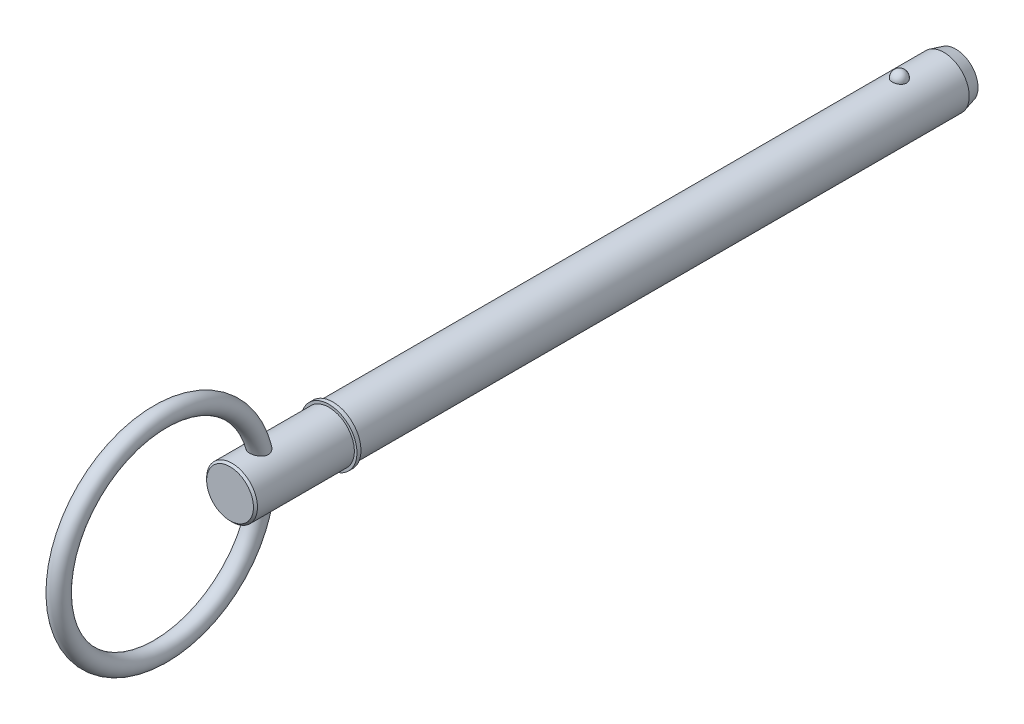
ISO-10303-21;
HEADER;
FILE_DESCRIPTION(('STEP AP214'),'2;1');
FILE_NAME('part.step','',(''),(''),'','','');
FILE_SCHEMA(('AUTOMOTIVE_DESIGN { 1 0 10303 214 1 1 1 1 }'));
ENDSEC;
DATA;
#1=APPLICATION_CONTEXT('core data for automotive mechanical design processes');
#2=APPLICATION_PROTOCOL_DEFINITION('international standard','automotive_design',2000,#1);
#3=PRODUCT_CONTEXT('',#1,'mechanical');
#4=PRODUCT('Part','Part','',(#3));
#5=PRODUCT_RELATED_PRODUCT_CATEGORY('part','',(#4));
#6=PRODUCT_DEFINITION_FORMATION('','',#4);
#7=PRODUCT_DEFINITION_CONTEXT('part definition',#1,'design');
#8=PRODUCT_DEFINITION('design','',#6,#7);
#9=PRODUCT_DEFINITION_SHAPE('','',#8);
#10=(LENGTH_UNIT() NAMED_UNIT(*) SI_UNIT(.MILLI.,.METRE.));
#11=(NAMED_UNIT(*) PLANE_ANGLE_UNIT() SI_UNIT($,.RADIAN.));
#12=(NAMED_UNIT(*) SI_UNIT($,.STERADIAN.) SOLID_ANGLE_UNIT());
#13=UNCERTAINTY_MEASURE_WITH_UNIT(LENGTH_MEASURE(1.E-05),#10,'distance_accuracy_value','');
#14=(GEOMETRIC_REPRESENTATION_CONTEXT(3) GLOBAL_UNCERTAINTY_ASSIGNED_CONTEXT((#13)) GLOBAL_UNIT_ASSIGNED_CONTEXT((#10,
#11,#12)) REPRESENTATION_CONTEXT('',''));
#15=CARTESIAN_POINT('',(0.,0.,0.));
#16=DIRECTION('',(0.,0.,1.));
#17=DIRECTION('',(1.,0.,0.));
#18=AXIS2_PLACEMENT_3D('',#15,#16,#17);
#19=CARTESIAN_POINT('',(0.,0.,139.7));
#20=DIRECTION('',(0.,0.,-1.));
#21=DIRECTION('',(-1.,0.,0.));
#22=AXIS2_PLACEMENT_3D('',#19,#20,#21);
#23=CYLINDRICAL_SURFACE('',#22,6.35);
#24=CARTESIAN_POINT('',(1.76243001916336,6.10051968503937,-1.78));
#25=CARTESIAN_POINT('',(1.76242835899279,6.10052111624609,-1.68050311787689));
#26=CARTESIAN_POINT('',(1.75431593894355,6.1028816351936,-1.58098521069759));
#27=CARTESIAN_POINT('',(1.72206027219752,6.11206037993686,-1.38476972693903));
#28=CARTESIAN_POINT('',(1.69791106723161,6.11888026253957,-1.28807321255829));
#29=CARTESIAN_POINT('',(1.63419596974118,6.13620287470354,-1.10029899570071));
#30=CARTESIAN_POINT('',(1.59463684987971,6.14670398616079,-1.00921884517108));
#31=CARTESIAN_POINT('',(1.50108569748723,6.17021534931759,-0.83516140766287));
#32=CARTESIAN_POINT('',(1.44709398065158,6.18322554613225,-0.752183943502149));
#33=CARTESIAN_POINT('',(1.3257243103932,6.21038081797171,-0.596209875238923));
#34=CARTESIAN_POINT('',(1.2582815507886,6.22453118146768,-0.523264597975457));
#35=CARTESIAN_POINT('',(1.11191624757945,6.25233390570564,-0.389855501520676));
#36=CARTESIAN_POINT('',(1.03299369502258,6.26598626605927,-0.329391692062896));
#37=CARTESIAN_POINT('',(0.866022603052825,6.29123226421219,-0.222793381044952));
#38=CARTESIAN_POINT('',(0.778000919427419,6.30283170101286,-0.176618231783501));
#39=CARTESIAN_POINT('',(0.59510847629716,6.32272058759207,-0.0996905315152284));
#40=CARTESIAN_POINT('',(0.500238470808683,6.33101040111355,-0.0689362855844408));
#41=CARTESIAN_POINT('',(0.308164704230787,6.34323464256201,-0.024159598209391));
#42=CARTESIAN_POINT('',(0.211033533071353,6.34724467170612,-0.00984637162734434));
#43=CARTESIAN_POINT('',(0.0156629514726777,6.3507318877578,0.00262058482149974));
#44=CARTESIAN_POINT('',(-0.0825763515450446,6.35020951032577,0.000775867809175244));
#45=CARTESIAN_POINT('',(-0.275890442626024,6.34473055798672,-0.0188727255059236));
#46=CARTESIAN_POINT('',(-0.370990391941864,6.3398374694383,-0.0364481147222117));
#47=CARTESIAN_POINT('',(-0.556805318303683,6.32622723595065,-0.0867447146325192));
#48=CARTESIAN_POINT('',(-0.647520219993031,6.31751002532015,-0.119466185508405));
#49=CARTESIAN_POINT('',(-0.822606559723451,6.29711353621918,-0.199386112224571));
#50=CARTESIAN_POINT('',(-0.906938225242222,6.28541739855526,-0.246667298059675));
#51=CARTESIAN_POINT('',(-1.06646479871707,6.26032612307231,-0.354365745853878));
#52=CARTESIAN_POINT('',(-1.14165877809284,6.24693081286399,-0.41478434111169));
#53=CARTESIAN_POINT('',(-1.2823514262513,6.21959142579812,-0.548435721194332));
#54=CARTESIAN_POINT('',(-1.34763761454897,6.2056417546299,-0.621891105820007));
#55=CARTESIAN_POINT('',(-1.4651153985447,6.17896241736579,-0.778815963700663));
#56=CARTESIAN_POINT('',(-1.51730606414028,6.16623283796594,-0.862286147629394));
#57=CARTESIAN_POINT('',(-1.60782211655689,6.14325839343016,-1.03799158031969));
#58=CARTESIAN_POINT('',(-1.64598111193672,6.13304379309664,-1.13031660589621));
#59=CARTESIAN_POINT('',(-1.70661885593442,6.11644899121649,-1.32030667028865));
#60=CARTESIAN_POINT('',(-1.72909805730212,6.11006867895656,-1.41797155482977));
#61=CARTESIAN_POINT('',(-1.75775019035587,6.1018881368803,-1.61543246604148));
#62=CARTESIAN_POINT('',(-1.76399136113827,6.10006874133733,-1.71521779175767));
#63=CARTESIAN_POINT('',(-1.76020715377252,6.10116172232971,-1.91445126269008));
#64=CARTESIAN_POINT('',(-1.75018221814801,6.10407397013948,-2.01389941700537));
#65=CARTESIAN_POINT('',(-1.71421005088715,6.11427232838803,-2.20912106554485));
#66=CARTESIAN_POINT('',(-1.68834262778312,6.12153651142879,-2.30491043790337));
#67=CARTESIAN_POINT('',(-1.62139543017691,6.1396067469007,-2.49066180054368));
#68=CARTESIAN_POINT('',(-1.5803150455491,6.15041294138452,-2.58062355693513));
#69=CARTESIAN_POINT('',(-1.48369112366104,6.17443456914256,-2.75271428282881));
#70=CARTESIAN_POINT('',(-1.42806998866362,6.18766281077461,-2.83479789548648));
#71=CARTESIAN_POINT('',(-1.30386620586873,6.21501934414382,-2.98832532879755));
#72=CARTESIAN_POINT('',(-1.23528306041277,6.22914767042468,-3.05976874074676));
#73=CARTESIAN_POINT('',(-1.08663999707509,6.25679135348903,-3.19029656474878));
#74=CARTESIAN_POINT('',(-1.00653826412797,6.27030422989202,-3.24933392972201));
#75=CARTESIAN_POINT('',(-0.837212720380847,6.29514770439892,-3.35304657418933));
#76=CARTESIAN_POINT('',(-0.747989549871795,6.30647845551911,-3.39772286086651));
#77=CARTESIAN_POINT('',(-0.564098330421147,6.32556124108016,-3.47096393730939));
#78=CARTESIAN_POINT('',(-0.469512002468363,6.33335611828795,-3.49972259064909));
#79=CARTESIAN_POINT('',(-0.27663389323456,6.34470628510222,-3.54113722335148));
#80=CARTESIAN_POINT('',(-0.17834256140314,6.34826208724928,-3.55379514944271));
#81=CARTESIAN_POINT('',(0.0171660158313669,6.35071525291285,-3.56255473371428));
#82=CARTESIAN_POINT('',(0.114368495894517,6.34969931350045,-3.55896450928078));
#83=CARTESIAN_POINT('',(0.306746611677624,6.34331695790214,-3.53603383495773));
#84=CARTESIAN_POINT('',(0.401922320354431,6.33795069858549,-3.51669395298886));
#85=CARTESIAN_POINT('',(0.587203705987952,6.32347219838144,-3.4629173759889));
#86=CARTESIAN_POINT('',(0.677327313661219,6.31437430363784,-3.42853846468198));
#87=CARTESIAN_POINT('',(0.850462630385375,6.29339543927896,-3.34564128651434));
#88=CARTESIAN_POINT('',(0.933473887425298,6.2815142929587,-3.29712212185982));
#89=CARTESIAN_POINT('',(1.09144542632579,6.25601750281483,-3.18638742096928));
#90=CARTESIAN_POINT('',(1.16626195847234,6.24237795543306,-3.12397237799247));
#91=CARTESIAN_POINT('',(1.304448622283,6.21497285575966,-2.98755865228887));
#92=CARTESIAN_POINT('',(1.36781676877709,6.20120728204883,-2.91355796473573));
#93=CARTESIAN_POINT('',(1.48252779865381,6.17479923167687,-2.75456133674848));
#94=CARTESIAN_POINT('',(1.53364167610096,6.16218052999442,-2.66939613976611));
#95=CARTESIAN_POINT('',(1.62109397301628,6.13975602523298,-2.49147502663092));
#96=CARTESIAN_POINT('',(1.657437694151,6.12994921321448,-2.39872184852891));
#97=CARTESIAN_POINT('',(1.71127844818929,6.11512175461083,-2.21887622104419));
#98=CARTESIAN_POINT('',(1.73042646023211,6.10968903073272,-2.13230770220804));
#99=CARTESIAN_POINT('',(1.75600284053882,6.10238739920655,-1.95716498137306));
#100=CARTESIAN_POINT('',(1.76243149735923,6.10051841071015,-1.86859082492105));
#101=CARTESIAN_POINT('',(1.76243001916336,6.10051968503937,-1.78));
#102=B_SPLINE_CURVE_WITH_KNOTS('',3,(#24,#25,#26,#27,#28,#29,#30,#31,#32,#33,#34,#35,#36,#37,
#38,#39,#40,#41,#42,#43,#44,#45,#46,#47,#48,#49,#50,#51,#52,#53,#54,#55,#56,#57,#58,#59,#60,#61,
#62,#63,#64,#65,#66,#67,#68,#69,#70,#71,#72,#73,#74,#75,#76,#77,#78,#79,#80,#81,#82,#83,#84,#85,
#86,#87,#88,#89,#90,#91,#92,#93,#94,#95,#96,#97,#98,#99,#100,#101),.UNSPECIFIED.,.T.,.F.,(4,2,2,
2,2,2,2,2,2,2,2,2,2,2,2,2,2,2,2,2,2,2,2,2,2,2,2,2,2,2,2,2,2,2,2,2,2,2,4),(0.,0.298172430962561,
0.596455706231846,0.894608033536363,1.19275383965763,1.49237238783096,1.79199116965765,
2.09074960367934,2.38947519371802,2.68283180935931,2.97616022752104,3.26529599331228,
3.5544367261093,3.84525169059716,4.13609618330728,4.43249276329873,4.72891038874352,
5.02873757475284,5.32855610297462,5.62711261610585,5.92566100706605,6.22271765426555,
6.519786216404,6.81847366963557,7.11717259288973,7.41698459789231,7.71677557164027,
8.01283014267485,8.30884891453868,8.59927798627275,8.88969658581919,9.17900899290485,
9.46833977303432,9.76212836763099,10.0559678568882,10.3549321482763,10.6537890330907,
10.9192841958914,11.1847733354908),.UNSPECIFIED.);
#103=CARTESIAN_POINT('',(1.76243001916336,6.10051968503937,-1.78));
#104=VERTEX_POINT('',#103);
#105=EDGE_CURVE('E101',#104,#104,#102,.T.);
#106=ORIENTED_EDGE('',*,*,#105,.T.);
#107=EDGE_LOOP('',(#106));
#108=FACE_BOUND('',#107,.T.);
#109=CARTESIAN_POINT('',(0.,0.,-12.8799999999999));
#110=DIRECTION('',(0.,0.,-1.));
#111=DIRECTION('',(-1.,0.,0.));
#112=AXIS2_PLACEMENT_3D('',#109,#110,#111);
#113=CIRCLE('',#112,6.35);
#114=CARTESIAN_POINT('',(-6.35,0.,-12.8799999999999));
#115=VERTEX_POINT('',#114);
#116=EDGE_CURVE('E108',#115,#115,#113,.F.);
#117=ORIENTED_EDGE('',*,*,#116,.T.);
#118=EDGE_LOOP('',(#117));
#119=FACE_BOUND('',#118,.T.);
#120=CARTESIAN_POINT('',(0.,0.,139.7));
#121=DIRECTION('',(0.,0.,1.));
#122=DIRECTION('',(1.,0.,0.));
#123=AXIS2_PLACEMENT_3D('',#120,#121,#122);
#124=CIRCLE('',#123,6.35);
#125=CARTESIAN_POINT('',(6.35,0.,139.7));
#126=VERTEX_POINT('',#125);
#127=EDGE_CURVE('E106',#126,#126,#124,.T.);
#128=ORIENTED_EDGE('',*,*,#127,.F.);
#129=EDGE_LOOP('',(#128));
#130=FACE_BOUND('',#129,.T.);
#131=ADVANCED_FACE('F39',(#108,#119,#130),#23,.T.);
#132=CARTESIAN_POINT('',(0.,0.,-15.88));
#133=DIRECTION('',(0.,0.,-1.));
#134=DIRECTION('',(-1.,0.,0.));
#135=AXIS2_PLACEMENT_3D('',#132,#133,#134);
#136=PLANE('',#135);
#137=CARTESIAN_POINT('',(0.,0.,-15.88));
#138=DIRECTION('',(0.,0.,-1.));
#139=DIRECTION('',(-1.,0.,0.));
#140=AXIS2_PLACEMENT_3D('',#137,#138,#139);
#141=CIRCLE('',#140,5.54615242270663);
#142=CARTESIAN_POINT('',(-5.54615242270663,0.,-15.88));
#143=VERTEX_POINT('',#142);
#144=EDGE_CURVE('E142',#143,#143,#141,.T.);
#145=ORIENTED_EDGE('',*,*,#144,.T.);
#146=EDGE_LOOP('',(#145));
#147=FACE_BOUND('',#146,.T.);
#148=ADVANCED_FACE('F87',(#147),#136,.T.);
#149=CARTESIAN_POINT('',(0.,0.,-15.88));
#150=DIRECTION('',(0.,0.,1.));
#151=DIRECTION('',(1.,0.,0.));
#152=AXIS2_PLACEMENT_3D('',#149,#150,#151);
#153=CONICAL_SURFACE('',#152,5.54615242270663,0.261799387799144);
#154=ORIENTED_EDGE('',*,*,#116,.F.);
#155=EDGE_LOOP('',(#154));
#156=FACE_BOUND('',#155,.T.);
#157=ORIENTED_EDGE('',*,*,#144,.F.);
#158=EDGE_LOOP('',(#157));
#159=FACE_BOUND('',#158,.T.);
#160=ADVANCED_FACE('F93',(#156,#159),#153,.T.);
#161=CARTESIAN_POINT('',(0.,6.35,-1.78));
#162=DIRECTION('',(0.,1.,0.));
#163=DIRECTION('',(0.,0.,1.));
#164=AXIS2_PLACEMENT_3D('',#161,#162,#163);
#165=SPHERICAL_SURFACE('',#164,1.78);
#166=ORIENTED_EDGE('',*,*,#105,.F.);
#167=EDGE_LOOP('',(#166));
#168=FACE_BOUND('',#167,.T.);
#169=ADVANCED_FACE('F111',(#168),#165,.T.);
#170=CARTESIAN_POINT('',(0.,0.,139.7));
#171=DIRECTION('',(0.,0.,-1.));
#172=DIRECTION('',(-1.,0.,0.));
#173=AXIS2_PLACEMENT_3D('',#170,#171,#172);
#174=PLANE('',#173);
#175=ORIENTED_EDGE('',*,*,#127,.T.);
#176=EDGE_LOOP('',(#175));
#177=FACE_BOUND('',#176,.T.);
#178=CARTESIAN_POINT('',(0.,0.,139.7));
#179=DIRECTION('',(0.,0.,-1.));
#180=DIRECTION('',(-1.,0.,0.));
#181=AXIS2_PLACEMENT_3D('',#178,#179,#180);
#182=CIRCLE('',#181,7.);
#183=CARTESIAN_POINT('',(-7.,0.,139.7));
#184=VERTEX_POINT('',#183);
#185=EDGE_CURVE('E107',#184,#184,#182,.T.);
#186=ORIENTED_EDGE('',*,*,#185,.T.);
#187=EDGE_LOOP('',(#186));
#188=FACE_BOUND('',#187,.T.);
#189=ADVANCED_FACE('F115',(#177,#188),#174,.T.);
#190=CARTESIAN_POINT('',(0.,0.,33.7287874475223));
#191=DIRECTION('',(0.,0.,-1.));
#192=DIRECTION('',(-1.,0.,0.));
#193=AXIS2_PLACEMENT_3D('',#190,#191,#192);
#194=CYLINDRICAL_SURFACE('',#193,7.);
#195=CARTESIAN_POINT('',(0.,0.,140.7));
#196=DIRECTION('',(0.,0.,-1.));
#197=DIRECTION('',(-1.,0.,0.));
#198=AXIS2_PLACEMENT_3D('',#195,#196,#197);
#199=CIRCLE('',#198,7.);
#200=CARTESIAN_POINT('',(-7.,0.,140.7));
#201=VERTEX_POINT('',#200);
#202=EDGE_CURVE('E132',#201,#201,#199,.T.);
#203=ORIENTED_EDGE('',*,*,#202,.T.);
#204=EDGE_LOOP('',(#203));
#205=FACE_BOUND('',#204,.T.);
#206=ORIENTED_EDGE('',*,*,#185,.F.);
#207=EDGE_LOOP('',(#206));
#208=FACE_BOUND('',#207,.T.);
#209=ADVANCED_FACE('F119',(#205,#208),#194,.T.);
#210=CARTESIAN_POINT('',(0.,7.,140.7));
#211=DIRECTION('',(0.,0.,1.));
#212=DIRECTION('',(1.,0.,0.));
#213=AXIS2_PLACEMENT_3D('',#210,#211,#212);
#214=PLANE('',#213);
#215=CARTESIAN_POINT('',(0.,0.,140.7));
#216=DIRECTION('',(0.,0.,1.));
#217=DIRECTION('',(1.,0.,0.));
#218=AXIS2_PLACEMENT_3D('',#215,#216,#217);
#219=CIRCLE('',#218,6.35);
#220=CARTESIAN_POINT('',(6.35,0.,140.7));
#221=VERTEX_POINT('',#220);
#222=EDGE_CURVE('E110',#221,#221,#219,.T.);
#223=ORIENTED_EDGE('',*,*,#222,.F.);
#224=EDGE_LOOP('',(#223));
#225=FACE_BOUND('',#224,.T.);
#226=ORIENTED_EDGE('',*,*,#202,.F.);
#227=EDGE_LOOP('',(#226));
#228=FACE_BOUND('',#227,.T.);
#229=ADVANCED_FACE('F84',(#225,#228),#214,.T.);
#230=CARTESIAN_POINT('',(0.,0.,165.4));
#231=DIRECTION('',(0.,0.,-1.));
#232=DIRECTION('',(-1.,0.,0.));
#233=AXIS2_PLACEMENT_3D('',#230,#231,#232);
#234=CYLINDRICAL_SURFACE('',#233,6.35);
#235=CARTESIAN_POINT('',(-1.08120660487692,-6.25727514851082,156.15158117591));
#236=CARTESIAN_POINT('',(-0.970724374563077,-6.27636409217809,156.093879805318));
#237=CARTESIAN_POINT('',(-0.855136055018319,-6.29329984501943,156.045219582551));
#238=CARTESIAN_POINT('',(-0.616958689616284,-6.32109419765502,155.96705594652));
#239=CARTESIAN_POINT('',(-0.494369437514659,-6.3319526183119,155.93755309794));
#240=CARTESIAN_POINT('',(-0.245606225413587,-6.34647141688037,155.898367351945));
#241=CARTESIAN_POINT('',(-0.119431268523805,-6.35012977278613,155.888690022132));
#242=CARTESIAN_POINT('',(0.132849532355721,-6.34986313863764,155.889400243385));
#243=CARTESIAN_POINT('',(0.258955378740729,-6.34593843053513,155.899787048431));
#244=CARTESIAN_POINT('',(0.506912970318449,-6.33094785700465,155.940285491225));
#245=CARTESIAN_POINT('',(0.628781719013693,-6.31991516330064,155.970305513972));
#246=CARTESIAN_POINT('',(0.865486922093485,-6.29187143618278,156.049308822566));
#247=CARTESIAN_POINT('',(0.980322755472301,-6.27485987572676,156.098293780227));
#248=CARTESIAN_POINT('',(1.20050616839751,-6.23649440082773,156.214540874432));
#249=CARTESIAN_POINT('',(1.30578867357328,-6.2151135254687,156.281917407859));
#250=CARTESIAN_POINT('',(1.50311440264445,-6.17036440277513,156.433359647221));
#251=CARTESIAN_POINT('',(1.59515714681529,-6.14699608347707,156.517425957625));
#252=CARTESIAN_POINT('',(1.76326863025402,-6.1009007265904,156.700247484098));
#253=CARTESIAN_POINT('',(1.83935482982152,-6.07817301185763,156.798986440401));
#254=CARTESIAN_POINT('',(1.97338559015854,-6.03599268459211,157.008703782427));
#255=CARTESIAN_POINT('',(2.03133638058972,-6.01653894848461,157.119677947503));
#256=CARTESIAN_POINT('',(2.12591205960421,-5.98376466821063,157.347018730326));
#257=CARTESIAN_POINT('',(2.16315310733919,-5.97026970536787,157.463104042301));
#258=CARTESIAN_POINT('',(2.21830650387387,-5.94999923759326,157.700318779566));
#259=CARTESIAN_POINT('',(2.2362211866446,-5.94322292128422,157.821447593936));
#260=CARTESIAN_POINT('',(2.25273772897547,-5.93698111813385,158.063281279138));
#261=CARTESIAN_POINT('',(2.25163224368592,-5.93740484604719,158.183964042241));
#262=CARTESIAN_POINT('',(2.23167546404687,-5.94493297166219,158.423620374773));
#263=CARTESIAN_POINT('',(2.21281883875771,-5.9520393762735,158.542593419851));
#264=CARTESIAN_POINT('',(2.15679576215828,-5.97257680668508,158.783836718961));
#265=CARTESIAN_POINT('',(2.1185113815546,-5.98639144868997,158.90581287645));
#266=CARTESIAN_POINT('',(2.02470263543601,-6.01876484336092,159.142284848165));
#267=CARTESIAN_POINT('',(1.96916879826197,-6.03732620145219,159.256776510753));
#268=CARTESIAN_POINT('',(1.83526629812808,-6.07945247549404,159.487995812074));
#269=CARTESIAN_POINT('',(1.75507038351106,-6.10334207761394,159.603611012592));
#270=CARTESIAN_POINT('',(1.5765788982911,-6.15186551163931,159.819894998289));
#271=CARTESIAN_POINT('',(1.47827192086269,-6.17649980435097,159.920554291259));
#272=CARTESIAN_POINT('',(1.26306696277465,-6.22410762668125,160.105023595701));
#273=CARTESIAN_POINT('',(1.14585214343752,-6.2470408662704,160.188478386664));
#274=CARTESIAN_POINT('',(0.896825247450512,-6.28760987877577,160.331400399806));
#275=CARTESIAN_POINT('',(0.765036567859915,-6.30525397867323,160.390905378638));
#276=CARTESIAN_POINT('',(0.509454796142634,-6.330648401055,160.475263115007));
#277=CARTESIAN_POINT('',(0.386964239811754,-6.33940909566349,160.503695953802));
#278=CARTESIAN_POINT('',(0.200813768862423,-6.3471308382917,160.528680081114));
#279=CARTESIAN_POINT('',(0.138353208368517,-6.34880140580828,160.534063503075));
#280=CARTESIAN_POINT('',(0.0131841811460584,-6.35029448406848,160.53887386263));
#281=CARTESIAN_POINT('',(-0.0495242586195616,-6.35011719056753,160.538301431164));
#282=CARTESIAN_POINT('',(-0.219860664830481,-6.34710452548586,160.528597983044));
#283=CARTESIAN_POINT('',(-0.327176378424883,-6.34243953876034,160.513576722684));
#284=CARTESIAN_POINT('',(-0.537619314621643,-6.32808248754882,160.466673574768));
#285=CARTESIAN_POINT('',(-0.640746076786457,-6.31838987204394,160.434789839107));
#286=CARTESIAN_POINT('',(-0.841795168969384,-6.29478075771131,160.355337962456));
#287=CARTESIAN_POINT('',(-0.939631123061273,-6.28081033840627,160.30756888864));
#288=CARTESIAN_POINT('',(-1.12690564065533,-6.2499288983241,160.198513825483));
#289=CARTESIAN_POINT('',(-1.21634109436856,-6.2330167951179,160.137222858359));
#290=CARTESIAN_POINT('',(-1.39713031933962,-6.19517308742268,159.994039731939));
#291=CARTESIAN_POINT('',(-1.48711596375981,-6.17400700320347,159.910483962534));
#292=CARTESIAN_POINT('',(-1.65373642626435,-6.13148145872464,159.730996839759));
#293=CARTESIAN_POINT('',(-1.73036130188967,-6.11012186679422,159.63505636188));
#294=CARTESIAN_POINT('',(-1.87908981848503,-6.0661652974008,159.418620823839));
#295=CARTESIAN_POINT('',(-1.94902044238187,-6.04382072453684,159.296572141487));
#296=CARTESIAN_POINT('',(-2.06849605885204,-6.00398244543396,159.042070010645));
#297=CARTESIAN_POINT('',(-2.11803457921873,-5.98649027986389,158.909613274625));
#298=CARTESIAN_POINT('',(-2.19551930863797,-5.95851933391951,158.634593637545));
#299=CARTESIAN_POINT('',(-2.22297667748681,-5.94819998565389,158.491874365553));
#300=CARTESIAN_POINT('',(-2.25222139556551,-5.93719450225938,158.203480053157));
#301=CARTESIAN_POINT('',(-2.25403508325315,-5.93649848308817,158.057808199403));
#302=CARTESIAN_POINT('',(-2.23178480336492,-5.94489150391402,157.783804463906));
#303=CARTESIAN_POINT('',(-2.21035650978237,-5.95298402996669,157.655226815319));
#304=CARTESIAN_POINT('',(-2.14565882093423,-5.97660650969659,157.40440891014));
#305=CARTESIAN_POINT('',(-2.10239634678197,-5.99213410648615,157.282166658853));
#306=CARTESIAN_POINT('',(-1.99913159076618,-6.02732890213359,157.056747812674));
#307=CARTESIAN_POINT('',(-1.94060271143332,-6.0466053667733,156.952829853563));
#308=CARTESIAN_POINT('',(-1.80736340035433,-6.0877569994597,156.756534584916));
#309=CARTESIAN_POINT('',(-1.73265259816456,-6.10963222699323,156.664157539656));
#310=CARTESIAN_POINT('',(-1.56865095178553,-6.15378470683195,156.492603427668));
#311=CARTESIAN_POINT('',(-1.47928749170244,-6.17606344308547,156.413496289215));
#312=CARTESIAN_POINT('',(-1.28858731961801,-6.21864788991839,156.270675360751));
#313=CARTESIAN_POINT('',(-1.18724893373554,-6.23895332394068,156.206963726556));
#314=CARTESIAN_POINT('',(-1.08120660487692,-6.25727514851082,156.15158117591));
#315=B_SPLINE_CURVE_WITH_KNOTS('',3,(#235,#236,#237,#238,#239,#240,#241,#242,#243,#244,#245,
#246,#247,#248,#249,#250,#251,#252,#253,#254,#255,#256,#257,#258,#259,#260,#261,#262,#263,#264,
#265,#266,#267,#268,#269,#270,#271,#272,#273,#274,#275,#276,#277,#278,#279,#280,#281,#282,#283,
#284,#285,#286,#287,#288,#289,#290,#291,#292,#293,#294,#295,#296,#297,#298,#299,#300,#301,#302,
#303,#304,#305,#306,#307,#308,#309,#310,#311,#312,#313,#314),.UNSPECIFIED.,.T.,.F.,(4,2,2,2,2,2,
2,2,2,2,2,2,2,2,2,2,2,2,2,2,2,2,2,2,2,2,2,2,2,2,2,2,2,2,2,2,2,2,2,4),(0.,0.377861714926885,
0.755734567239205,1.13371352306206,1.51167842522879,1.88789208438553,2.26413891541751,
2.64278156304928,3.02143792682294,3.3996777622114,3.77778752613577,4.14394628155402,
4.51006081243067,4.87054720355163,5.23114188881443,5.61534494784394,5.99975934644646,
6.42600522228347,6.8525204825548,7.28711365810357,7.72101899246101,8.09666132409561,
8.28452949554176,8.47237776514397,8.7960795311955,9.11981678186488,9.44781545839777,
9.77593508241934,10.1483085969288,10.5209580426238,10.9463240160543,11.3718248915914,
11.8065046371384,12.240737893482,12.6304236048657,13.0199858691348,13.3807583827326,
13.7415391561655,14.104165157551,14.4668419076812),.UNSPECIFIED.);
#316=CARTESIAN_POINT('',(-1.08120660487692,-6.25727514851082,156.15158117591));
#317=VERTEX_POINT('',#316);
#318=EDGE_CURVE('E10',#317,#317,#315,.T.);
#319=ORIENTED_EDGE('',*,*,#318,.F.);
#320=EDGE_LOOP('',(#319));
#321=FACE_BOUND('',#320,.T.);
#322=CARTESIAN_POINT('',(-1.08120660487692,6.25727514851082,156.15158117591));
#323=CARTESIAN_POINT('',(-1.19093168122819,6.23831652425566,156.208887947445));
#324=CARTESIAN_POINT('',(-1.29562751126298,6.21723224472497,156.275116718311));
#325=CARTESIAN_POINT('',(-1.49211272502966,6.17302620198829,156.424020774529));
#326=CARTESIAN_POINT('',(-1.58390200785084,6.14990442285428,156.506696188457));
#327=CARTESIAN_POINT('',(-1.75209695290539,6.10411985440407,156.686777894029));
#328=CARTESIAN_POINT('',(-1.82848346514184,6.08145766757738,156.784202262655));
#329=CARTESIAN_POINT('',(-1.96346259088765,6.03923311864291,156.991273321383));
#330=CARTESIAN_POINT('',(-2.02206050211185,6.01966983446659,157.100916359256));
#331=CARTESIAN_POINT('',(-2.11860444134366,5.9863659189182,157.326564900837));
#332=CARTESIAN_POINT('',(-2.15701637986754,5.97249571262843,157.442351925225));
#333=CARTESIAN_POINT('',(-2.21449304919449,5.95142584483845,157.679191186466));
#334=CARTESIAN_POINT('',(-2.23356015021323,5.94422536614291,157.800242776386));
#335=CARTESIAN_POINT('',(-2.25228141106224,5.93715610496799,158.041944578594));
#336=CARTESIAN_POINT('',(-2.25225786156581,5.93716560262,158.162567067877));
#337=CARTESIAN_POINT('',(-2.2344206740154,5.94389982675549,158.402277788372));
#338=CARTESIAN_POINT('',(-2.21660184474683,5.95062651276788,158.521365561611));
#339=CARTESIAN_POINT('',(-2.16272689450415,5.97042554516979,158.762705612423));
#340=CARTESIAN_POINT('',(-2.12559286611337,5.98387086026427,158.884684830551));
#341=CARTESIAN_POINT('',(-2.03409944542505,6.01558578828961,159.121342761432));
#342=CARTESIAN_POINT('',(-1.97973080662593,6.03385799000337,159.236017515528));
#343=CARTESIAN_POINT('',(-1.84828023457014,6.07549301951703,159.467865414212));
#344=CARTESIAN_POINT('',(-1.76936622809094,6.09919386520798,159.583943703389));
#345=CARTESIAN_POINT('',(-1.59344783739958,6.14749881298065,159.801420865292));
#346=CARTESIAN_POINT('',(-1.49643151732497,6.17210350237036,159.902809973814));
#347=CARTESIAN_POINT('',(-1.28333318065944,6.21994692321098,160.089508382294));
#348=CARTESIAN_POINT('',(-1.1668572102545,6.24314005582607,160.1743845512));
#349=CARTESIAN_POINT('',(-0.919062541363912,6.2843871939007,160.32034404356));
#350=CARTESIAN_POINT('',(-0.78776676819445,6.30244898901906,160.381463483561));
#351=CARTESIAN_POINT('',(-0.532335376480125,6.32876911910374,160.46911129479));
#352=CARTESIAN_POINT('',(-0.409516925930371,6.33800211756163,160.499123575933));
#353=CARTESIAN_POINT('',(-0.222636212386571,6.34640533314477,160.526338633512));
#354=CARTESIAN_POINT('',(-0.159893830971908,6.34829860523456,160.532442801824));
#355=CARTESIAN_POINT('',(-0.0340877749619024,6.35021985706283,160.53863417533));
#356=CARTESIAN_POINT('',(0.0289758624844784,6.35024804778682,160.53872206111));
#357=CARTESIAN_POINT('',(0.200008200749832,6.34776620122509,160.530732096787));
#358=CARTESIAN_POINT('',(0.307730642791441,6.34342046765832,160.51675007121));
#359=CARTESIAN_POINT('',(0.51913450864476,6.32963338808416,160.471765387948));
#360=CARTESIAN_POINT('',(0.622815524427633,6.3201915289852,160.440761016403));
#361=CARTESIAN_POINT('',(0.824580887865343,6.2970603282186,160.363086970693));
#362=CARTESIAN_POINT('',(0.922611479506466,6.28333629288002,160.316289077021));
#363=CARTESIAN_POINT('',(1.11039970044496,6.2528858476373,160.209122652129));
#364=CARTESIAN_POINT('',(1.20015435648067,6.23615836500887,160.148749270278));
#365=CARTESIAN_POINT('',(1.38155818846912,6.19866747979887,160.00760245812));
#366=CARTESIAN_POINT('',(1.47187645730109,6.17766310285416,159.925184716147));
#367=CARTESIAN_POINT('',(1.63933626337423,6.13535258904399,159.747946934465));
#368=CARTESIAN_POINT('',(1.71646809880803,6.11404624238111,159.653117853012));
#369=CARTESIAN_POINT('',(1.86660460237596,6.07002946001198,159.438851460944));
#370=CARTESIAN_POINT('',(1.93743710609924,6.04755477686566,159.317834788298));
#371=CARTESIAN_POINT('',(2.05894300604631,6.00727604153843,159.065280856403));
#372=CARTESIAN_POINT('',(2.10960917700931,5.98947366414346,158.933739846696));
#373=CARTESIAN_POINT('',(2.18982014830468,5.96062717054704,158.659758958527));
#374=CARTESIAN_POINT('',(2.21877575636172,5.94977267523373,158.517123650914));
#375=CARTESIAN_POINT('',(2.25104759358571,5.93764416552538,158.228595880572));
#376=CARTESIAN_POINT('',(2.25438985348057,5.93636042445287,158.082706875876));
#377=CARTESIAN_POINT('',(2.23498011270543,5.94368858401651,157.807731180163));
#378=CARTESIAN_POINT('',(2.21482640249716,5.95131530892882,157.678434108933));
#379=CARTESIAN_POINT('',(2.15248760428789,5.97414352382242,157.425969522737));
#380=CARTESIAN_POINT('',(2.11031020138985,5.98934237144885,157.302799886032));
#381=CARTESIAN_POINT('',(2.00904610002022,6.02402214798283,157.075783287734));
#382=CARTESIAN_POINT('',(1.95150192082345,6.04308594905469,156.971178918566));
#383=CARTESIAN_POINT('',(1.82009972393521,6.08395083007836,156.773382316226));
#384=CARTESIAN_POINT('',(1.74624088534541,6.10575204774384,156.680190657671));
#385=CARTESIAN_POINT('',(1.58309476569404,6.15008431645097,156.506164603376));
#386=CARTESIAN_POINT('',(1.49360904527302,6.17262128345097,156.425518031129));
#387=CARTESIAN_POINT('',(1.30231515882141,6.21579297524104,156.279836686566));
#388=CARTESIAN_POINT('',(1.20050521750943,6.23642742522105,156.21480416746));
#389=CARTESIAN_POINT('',(0.983786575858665,6.27432316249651,156.0998596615));
#390=CARTESIAN_POINT('',(0.868563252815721,6.29145558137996,156.050497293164));
#391=CARTESIAN_POINT('',(0.630994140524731,6.31970327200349,155.970885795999));
#392=CARTESIAN_POINT('',(0.508648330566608,6.33081852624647,155.940636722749));
#393=CARTESIAN_POINT('',(0.259933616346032,6.34590352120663,155.899879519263));
#394=CARTESIAN_POINT('',(0.133554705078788,6.34985380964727,155.889425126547));
#395=CARTESIAN_POINT('',(-0.119270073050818,6.35013815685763,155.888667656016));
#396=CARTESIAN_POINT('',(-0.245715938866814,6.34647233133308,155.898364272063));
#397=CARTESIAN_POINT('',(-0.494670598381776,6.33192772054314,155.937620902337));
#398=CARTESIAN_POINT('',(-0.617189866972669,6.3210701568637,155.967122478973));
#399=CARTESIAN_POINT('',(-0.855240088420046,6.29328476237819,156.045263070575));
#400=CARTESIAN_POINT('',(-0.970770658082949,6.27635659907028,156.093903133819));
#401=CARTESIAN_POINT('',(-1.08120660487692,6.25727514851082,156.15158117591));
#402=B_SPLINE_CURVE_WITH_KNOTS('',3,(#322,#323,#324,#325,#326,#327,#328,#329,#330,#331,#332,
#333,#334,#335,#336,#337,#338,#339,#340,#341,#342,#343,#344,#345,#346,#347,#348,#349,#350,#351,
#352,#353,#354,#355,#356,#357,#358,#359,#360,#361,#362,#363,#364,#365,#366,#367,#368,#369,#370,
#371,#372,#373,#374,#375,#376,#377,#378,#379,#380,#381,#382,#383,#384,#385,#386,#387,#388,#389,
#390,#391,#392,#393,#394,#395,#396,#397,#398,#399,#400,#401),.UNSPECIFIED.,.T.,.F.,(4,2,2,2,2,2,
2,2,2,2,2,2,2,2,2,2,2,2,2,2,2,2,2,2,2,2,2,2,2,2,2,2,2,2,2,2,2,2,2,4),(0.,0.375258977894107,
0.750520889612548,1.12624651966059,1.50186014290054,1.86837438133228,2.23484370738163,
2.59512638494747,2.95551419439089,3.33859924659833,3.7218901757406,4.14704029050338,
4.57247172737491,5.00788576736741,5.44263524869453,5.82040093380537,6.00932292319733,
6.19822354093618,6.52266071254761,6.8471305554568,7.17430063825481,7.50158780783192,
7.87233275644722,8.24334931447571,8.66748794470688,9.09177840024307,9.52720369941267,
9.96218641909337,10.3532895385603,10.7442562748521,11.1052784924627,11.4663188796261,
11.8323306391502,12.1983951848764,12.5761580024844,12.9539219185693,13.3327099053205,
13.7114921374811,14.0891615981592,14.4668517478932),.UNSPECIFIED.);
#403=CARTESIAN_POINT('',(-1.08120660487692,6.25727514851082,156.15158117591));
#404=VERTEX_POINT('',#403);
#405=EDGE_CURVE('E51',#404,#404,#402,.T.);
#406=ORIENTED_EDGE('',*,*,#405,.F.);
#407=EDGE_LOOP('',(#406));
#408=FACE_BOUND('',#407,.T.);
#409=CARTESIAN_POINT('',(0.,0.,164.9));
#410=DIRECTION('',(0.,0.,-1.));
#411=DIRECTION('',(-1.,0.,0.));
#412=AXIS2_PLACEMENT_3D('',#409,#410,#411);
#413=CIRCLE('',#412,6.35);
#414=CARTESIAN_POINT('',(-6.35,0.,164.9));
#415=VERTEX_POINT('',#414);
#416=EDGE_CURVE('E63',#415,#415,#413,.T.);
#417=ORIENTED_EDGE('',*,*,#416,.T.);
#418=EDGE_LOOP('',(#417));
#419=FACE_BOUND('',#418,.T.);
#420=ORIENTED_EDGE('',*,*,#222,.T.);
#421=EDGE_LOOP('',(#420));
#422=FACE_BOUND('',#421,.T.);
#423=ADVANCED_FACE('F68',(#321,#408,#419,#422),#234,.T.);
#424=CARTESIAN_POINT('',(0.,0.,165.4));
#425=DIRECTION('',(0.,0.,-1.));
#426=DIRECTION('',(-1.,0.,0.));
#427=AXIS2_PLACEMENT_3D('',#424,#425,#426);
#428=PLANE('',#427);
#429=CARTESIAN_POINT('',(0.,0.,165.4));
#430=DIRECTION('',(0.,0.,-1.));
#431=DIRECTION('',(-1.,0.,0.));
#432=AXIS2_PLACEMENT_3D('',#429,#430,#431);
#433=CIRCLE('',#432,5.84999999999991);
#434=CARTESIAN_POINT('',(-5.84999999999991,0.,165.4));
#435=VERTEX_POINT('',#434);
#436=EDGE_CURVE('E57',#435,#435,#433,.F.);
#437=ORIENTED_EDGE('',*,*,#436,.T.);
#438=EDGE_LOOP('',(#437));
#439=FACE_BOUND('',#438,.T.);
#440=ADVANCED_FACE('F75',(#439),#428,.F.);
#441=CARTESIAN_POINT('',(0.,0.,164.9));
#442=DIRECTION('',(0.,0.,-1.));
#443=DIRECTION('',(-1.,0.,0.));
#444=AXIS2_PLACEMENT_3D('',#441,#442,#443);
#445=CONICAL_SURFACE('',#444,6.35,0.785398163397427);
#446=ORIENTED_EDGE('',*,*,#436,.F.);
#447=EDGE_LOOP('',(#446));
#448=FACE_BOUND('',#447,.T.);
#449=ORIENTED_EDGE('',*,*,#416,.F.);
#450=EDGE_LOOP('',(#449));
#451=FACE_BOUND('',#450,.T.);
#452=ADVANCED_FACE('F41',(#448,#451),#445,.T.);
#453=CARTESIAN_POINT('',(0.,0.,182.8));
#454=DIRECTION('',(1.,0.,0.));
#455=DIRECTION('',(0.,0.,-1.));
#456=AXIS2_PLACEMENT_3D('',#453,#454,#455);
#457=TOROIDAL_SURFACE('',#456,25.4,2.25);
#458=ORIENTED_EDGE('',*,*,#318,.T.);
#459=EDGE_LOOP('',(#458));
#460=FACE_BOUND('',#459,.T.);
#461=ORIENTED_EDGE('',*,*,#405,.T.);
#462=EDGE_LOOP('',(#461));
#463=FACE_BOUND('',#462,.T.);
#464=ADVANCED_FACE('F72',(#460,#463),#457,.T.);
#465=CLOSED_SHELL('',(#131,#148,#160,#169,#189,#209,#229,#423,#440,#452,#464));
#466=MANIFOLD_SOLID_BREP('B2',#465);
#467=ADVANCED_BREP_SHAPE_REPRESENTATION('',(#18,#466),#14);
#468=SHAPE_DEFINITION_REPRESENTATION(#9,#467);
ENDSEC;
END-ISO-10303-21;
